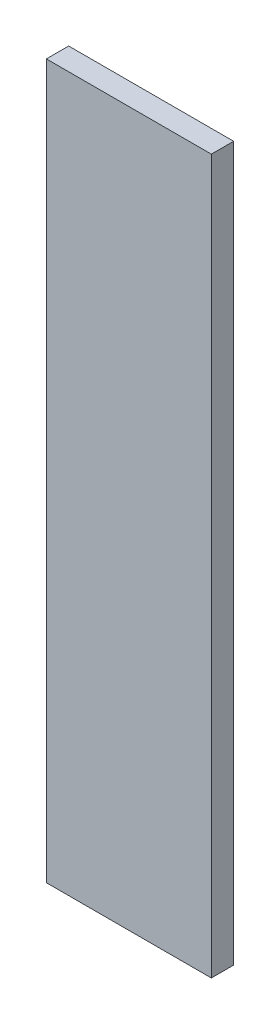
from build123d import *

# Parameters (mm, degrees)
SKETCH1_W           = 37
SKETCH1_H           = 160
BOSS_EXTRUDE1_DEPTH = 5


with BuildPart() as part:
    # Sketch1 → Boss-Extrude1 (new body)
    with BuildSketch(Plane.XY):
        with Locations((-18.5, -5)):
            Rectangle(SKETCH1_W, SKETCH1_H)
    extrude(amount=BOSS_EXTRUDE1_DEPTH)


solid = part.part
